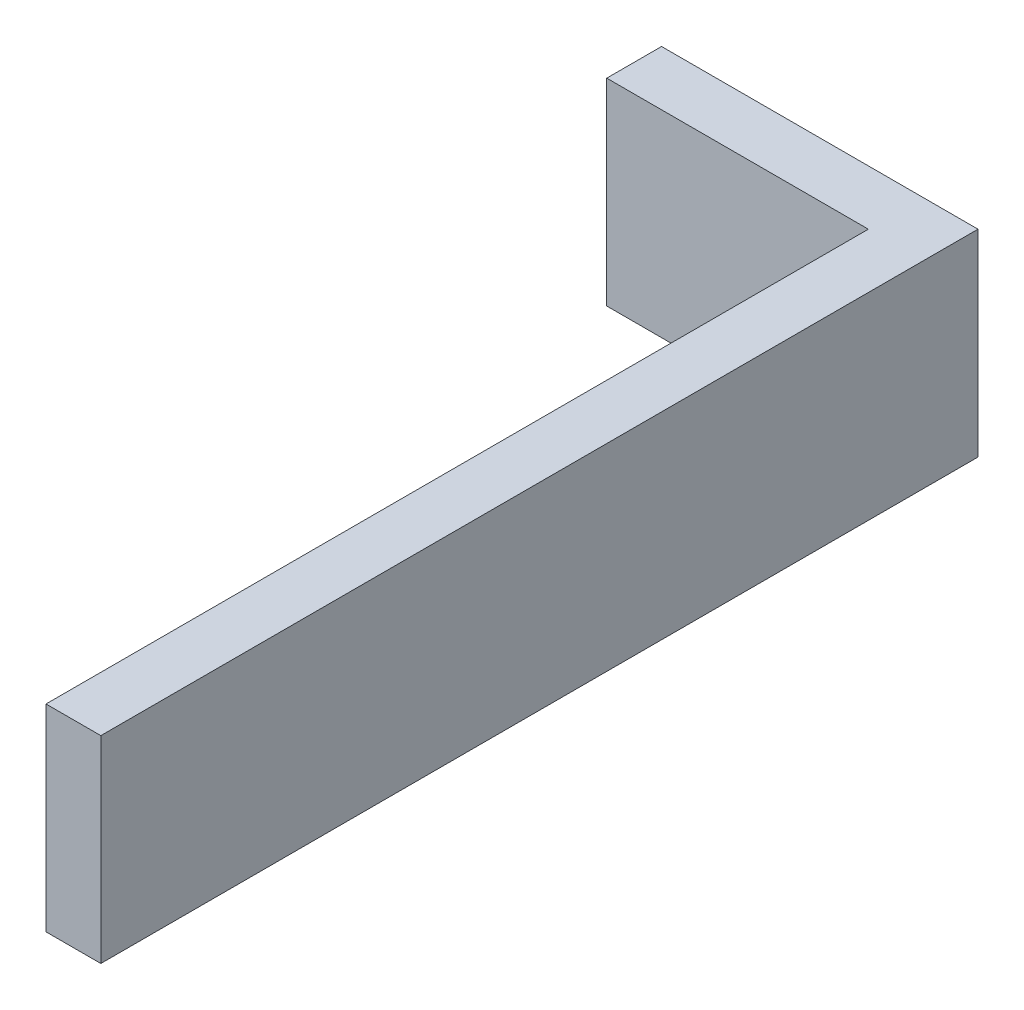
from build123d import *

# Parameters (mm, degrees)
EXTRUDE_THIN1_DEPTH = 11.43


with BuildPart() as part:
    # Sketch2 → Extrude-Thin1 (new body)
    with BuildSketch(Plane(origin=(0, 0, 0), x_dir=(1, 0, 0), z_dir=(0, 1, 0))):
        Polygon((-18.3261, 0), (0, 0), (0, -50.8), (-3.175, -50.8), (-3.175, -3.175), (-18.3261, -3.175), align=None)
    extrude(amount=EXTRUDE_THIN1_DEPTH)


solid = part.part
